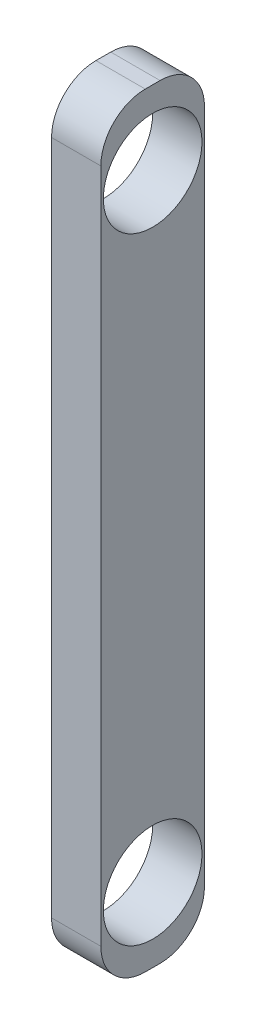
ISO-10303-21;
HEADER;
FILE_DESCRIPTION(('STEP AP214'),'2;1');
FILE_NAME('part.step','',(''),(''),'','','');
FILE_SCHEMA(('AUTOMOTIVE_DESIGN { 1 0 10303 214 1 1 1 1 }'));
ENDSEC;
DATA;
#1=APPLICATION_CONTEXT('core data for automotive mechanical design processes');
#2=APPLICATION_PROTOCOL_DEFINITION('international standard','automotive_design',2000,#1);
#3=PRODUCT_CONTEXT('',#1,'mechanical');
#4=PRODUCT('Part','Part','',(#3));
#5=PRODUCT_RELATED_PRODUCT_CATEGORY('part','',(#4));
#6=PRODUCT_DEFINITION_FORMATION('','',#4);
#7=PRODUCT_DEFINITION_CONTEXT('part definition',#1,'design');
#8=PRODUCT_DEFINITION('design','',#6,#7);
#9=PRODUCT_DEFINITION_SHAPE('','',#8);
#10=(LENGTH_UNIT() NAMED_UNIT(*) SI_UNIT(.MILLI.,.METRE.));
#11=(NAMED_UNIT(*) PLANE_ANGLE_UNIT() SI_UNIT($,.RADIAN.));
#12=(NAMED_UNIT(*) SI_UNIT($,.STERADIAN.) SOLID_ANGLE_UNIT());
#13=UNCERTAINTY_MEASURE_WITH_UNIT(LENGTH_MEASURE(1.E-05),#10,'distance_accuracy_value','');
#14=(GEOMETRIC_REPRESENTATION_CONTEXT(3) GLOBAL_UNCERTAINTY_ASSIGNED_CONTEXT((#13)) GLOBAL_UNIT_ASSIGNED_CONTEXT((#10,
#11,#12)) REPRESENTATION_CONTEXT('',''));
#15=CARTESIAN_POINT('',(0.,0.,0.));
#16=DIRECTION('',(0.,0.,1.));
#17=DIRECTION('',(1.,0.,0.));
#18=AXIS2_PLACEMENT_3D('',#15,#16,#17);
#19=CARTESIAN_POINT('',(2.,0.,0.));
#20=DIRECTION('',(1.,0.,0.));
#21=DIRECTION('',(0.,0.,-1.));
#22=AXIS2_PLACEMENT_3D('',#19,#20,#21);
#23=PLANE('',#22);
#24=CARTESIAN_POINT('',(2.,28.,0.));
#25=DIRECTION('',(1.,0.,0.));
#26=DIRECTION('',(0.,0.,-1.));
#27=AXIS2_PLACEMENT_3D('',#24,#25,#26);
#28=CIRCLE('',#27,2.);
#29=CARTESIAN_POINT('',(2.,28.,-2.));
#30=VERTEX_POINT('',#29);
#31=EDGE_CURVE('E143',#30,#30,#28,.T.);
#32=ORIENTED_EDGE('',*,*,#31,.F.);
#33=EDGE_LOOP('',(#32));
#34=FACE_BOUND('',#33,.T.);
#35=DIRECTION('',(0.,-1.,0.));
#36=VECTOR('',#35,1.);
#37=CARTESIAN_POINT('',(2.,31.,2.1));
#38=LINE('',#37,#36);
#39=CARTESIAN_POINT('',(2.,29.2,2.1));
#40=VERTEX_POINT('',#39);
#41=CARTESIAN_POINT('',(2.,1.8,2.1));
#42=VERTEX_POINT('',#41);
#43=EDGE_CURVE('E148',#40,#42,#38,.T.);
#44=ORIENTED_EDGE('',*,*,#43,.T.);
#45=CARTESIAN_POINT('',(2.,1.8,0.299999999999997));
#46=DIRECTION('',(1.,0.,0.));
#47=DIRECTION('',(0.,0.,-1.));
#48=AXIS2_PLACEMENT_3D('',#45,#46,#47);
#49=CIRCLE('',#48,1.8);
#50=CARTESIAN_POINT('',(2.,0.,0.299999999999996));
#51=VERTEX_POINT('',#50);
#52=EDGE_CURVE('E163',#42,#51,#49,.T.);
#53=ORIENTED_EDGE('',*,*,#52,.T.);
#54=DIRECTION('',(0.,0.,-1.));
#55=VECTOR('',#54,1.);
#56=CARTESIAN_POINT('',(2.,0.,2.1));
#57=LINE('',#56,#55);
#58=CARTESIAN_POINT('',(2.,0.,-0.300000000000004));
#59=VERTEX_POINT('',#58);
#60=EDGE_CURVE('E130',#51,#59,#57,.T.);
#61=ORIENTED_EDGE('',*,*,#60,.T.);
#62=CARTESIAN_POINT('',(2.,1.8,-0.300000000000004));
#63=DIRECTION('',(1.,0.,0.));
#64=DIRECTION('',(0.,0.,-1.));
#65=AXIS2_PLACEMENT_3D('',#62,#63,#64);
#66=CIRCLE('',#65,1.8);
#67=CARTESIAN_POINT('',(2.,1.8,-2.1));
#68=VERTEX_POINT('',#67);
#69=EDGE_CURVE('E161',#59,#68,#66,.T.);
#70=ORIENTED_EDGE('',*,*,#69,.T.);
#71=DIRECTION('',(0.,1.,0.));
#72=VECTOR('',#71,1.);
#73=CARTESIAN_POINT('',(2.,0.,-2.1));
#74=LINE('',#73,#72);
#75=CARTESIAN_POINT('',(2.,29.2,-2.1));
#76=VERTEX_POINT('',#75);
#77=EDGE_CURVE('E183',#68,#76,#74,.T.);
#78=ORIENTED_EDGE('',*,*,#77,.T.);
#79=CARTESIAN_POINT('',(2.,29.2,-0.3));
#80=DIRECTION('',(1.,0.,0.));
#81=DIRECTION('',(0.,0.,-1.));
#82=AXIS2_PLACEMENT_3D('',#79,#80,#81);
#83=CIRCLE('',#82,1.8);
#84=CARTESIAN_POINT('',(2.,31.,-0.3));
#85=VERTEX_POINT('',#84);
#86=EDGE_CURVE('E65',#76,#85,#83,.T.);
#87=ORIENTED_EDGE('',*,*,#86,.T.);
#88=DIRECTION('',(0.,0.,1.));
#89=VECTOR('',#88,1.);
#90=CARTESIAN_POINT('',(2.,31.,-2.1));
#91=LINE('',#90,#89);
#92=CARTESIAN_POINT('',(2.,31.,0.3));
#93=VERTEX_POINT('',#92);
#94=EDGE_CURVE('E149',#85,#93,#91,.T.);
#95=ORIENTED_EDGE('',*,*,#94,.T.);
#96=CARTESIAN_POINT('',(2.,29.2,0.3));
#97=DIRECTION('',(1.,0.,0.));
#98=DIRECTION('',(0.,0.,-1.));
#99=AXIS2_PLACEMENT_3D('',#96,#97,#98);
#100=CIRCLE('',#99,1.8);
#101=EDGE_CURVE('E159',#93,#40,#100,.T.);
#102=ORIENTED_EDGE('',*,*,#101,.T.);
#103=EDGE_LOOP('',(#44,#53,#61,#70,#78,#87,#95,#102));
#104=FACE_BOUND('',#103,.T.);
#105=CARTESIAN_POINT('',(2.,3.,0.));
#106=DIRECTION('',(1.,0.,0.));
#107=DIRECTION('',(0.,0.,-1.));
#108=AXIS2_PLACEMENT_3D('',#105,#106,#107);
#109=CIRCLE('',#108,2.);
#110=CARTESIAN_POINT('',(2.,3.,-2.));
#111=VERTEX_POINT('',#110);
#112=EDGE_CURVE('E195',#111,#111,#109,.T.);
#113=ORIENTED_EDGE('',*,*,#112,.F.);
#114=EDGE_LOOP('',(#113));
#115=FACE_BOUND('',#114,.T.);
#116=ADVANCED_FACE('F45',(#34,#104,#115),#23,.T.);
#117=CARTESIAN_POINT('',(0.,0.,0.));
#118=DIRECTION('',(1.,0.,0.));
#119=DIRECTION('',(0.,0.,-1.));
#120=AXIS2_PLACEMENT_3D('',#117,#118,#119);
#121=PLANE('',#120);
#122=DIRECTION('',(0.,0.,-1.));
#123=VECTOR('',#122,1.);
#124=CARTESIAN_POINT('',(0.,0.,2.1));
#125=LINE('',#124,#123);
#126=CARTESIAN_POINT('',(0.,0.,0.299999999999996));
#127=VERTEX_POINT('',#126);
#128=CARTESIAN_POINT('',(0.,0.,-0.300000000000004));
#129=VERTEX_POINT('',#128);
#130=EDGE_CURVE('E127',#127,#129,#125,.T.);
#131=ORIENTED_EDGE('',*,*,#130,.F.);
#132=CARTESIAN_POINT('',(0.,1.8,0.299999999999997));
#133=DIRECTION('',(1.,0.,0.));
#134=DIRECTION('',(0.,0.,-1.));
#135=AXIS2_PLACEMENT_3D('',#132,#133,#134);
#136=CIRCLE('',#135,1.8);
#137=CARTESIAN_POINT('',(0.,1.8,2.1));
#138=VERTEX_POINT('',#137);
#139=EDGE_CURVE('E110',#127,#138,#136,.F.);
#140=ORIENTED_EDGE('',*,*,#139,.T.);
#141=DIRECTION('',(0.,-1.,0.));
#142=VECTOR('',#141,1.);
#143=CARTESIAN_POINT('',(0.,31.,2.1));
#144=LINE('',#143,#142);
#145=CARTESIAN_POINT('',(0.,29.2,2.1));
#146=VERTEX_POINT('',#145);
#147=EDGE_CURVE('E138',#146,#138,#144,.T.);
#148=ORIENTED_EDGE('',*,*,#147,.F.);
#149=CARTESIAN_POINT('',(0.,29.2,0.3));
#150=DIRECTION('',(1.,0.,0.));
#151=DIRECTION('',(0.,0.,-1.));
#152=AXIS2_PLACEMENT_3D('',#149,#150,#151);
#153=CIRCLE('',#152,1.8);
#154=CARTESIAN_POINT('',(0.,31.,0.3));
#155=VERTEX_POINT('',#154);
#156=EDGE_CURVE('E152',#146,#155,#153,.F.);
#157=ORIENTED_EDGE('',*,*,#156,.T.);
#158=DIRECTION('',(0.,0.,1.));
#159=VECTOR('',#158,1.);
#160=CARTESIAN_POINT('',(0.,31.,-2.1));
#161=LINE('',#160,#159);
#162=CARTESIAN_POINT('',(0.,31.,-0.3));
#163=VERTEX_POINT('',#162);
#164=EDGE_CURVE('E141',#163,#155,#161,.T.);
#165=ORIENTED_EDGE('',*,*,#164,.F.);
#166=CARTESIAN_POINT('',(0.,29.2,-0.3));
#167=DIRECTION('',(1.,0.,0.));
#168=DIRECTION('',(0.,0.,-1.));
#169=AXIS2_PLACEMENT_3D('',#166,#167,#168);
#170=CIRCLE('',#169,1.8);
#171=CARTESIAN_POINT('',(0.,29.2,-2.1));
#172=VERTEX_POINT('',#171);
#173=EDGE_CURVE('E131',#163,#172,#170,.F.);
#174=ORIENTED_EDGE('',*,*,#173,.T.);
#175=DIRECTION('',(0.,1.,0.));
#176=VECTOR('',#175,1.);
#177=CARTESIAN_POINT('',(0.,0.,-2.1));
#178=LINE('',#177,#176);
#179=CARTESIAN_POINT('',(0.,1.8,-2.1));
#180=VERTEX_POINT('',#179);
#181=EDGE_CURVE('E137',#180,#172,#178,.T.);
#182=ORIENTED_EDGE('',*,*,#181,.F.);
#183=CARTESIAN_POINT('',(0.,1.8,-0.300000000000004));
#184=DIRECTION('',(1.,0.,0.));
#185=DIRECTION('',(0.,0.,-1.));
#186=AXIS2_PLACEMENT_3D('',#183,#184,#185);
#187=CIRCLE('',#186,1.8);
#188=EDGE_CURVE('E121',#180,#129,#187,.F.);
#189=ORIENTED_EDGE('',*,*,#188,.T.);
#190=EDGE_LOOP('',(#131,#140,#148,#157,#165,#174,#182,#189));
#191=FACE_BOUND('',#190,.T.);
#192=CARTESIAN_POINT('',(0.,28.,0.));
#193=DIRECTION('',(1.,0.,0.));
#194=DIRECTION('',(0.,0.,-1.));
#195=AXIS2_PLACEMENT_3D('',#192,#193,#194);
#196=CIRCLE('',#195,2.);
#197=CARTESIAN_POINT('',(0.,28.,-2.));
#198=VERTEX_POINT('',#197);
#199=EDGE_CURVE('E186',#198,#198,#196,.T.);
#200=ORIENTED_EDGE('',*,*,#199,.T.);
#201=EDGE_LOOP('',(#200));
#202=FACE_BOUND('',#201,.T.);
#203=CARTESIAN_POINT('',(0.,3.,0.));
#204=DIRECTION('',(1.,0.,0.));
#205=DIRECTION('',(0.,0.,-1.));
#206=AXIS2_PLACEMENT_3D('',#203,#204,#205);
#207=CIRCLE('',#206,2.);
#208=CARTESIAN_POINT('',(0.,3.,-2.));
#209=VERTEX_POINT('',#208);
#210=EDGE_CURVE('E197',#209,#209,#207,.T.);
#211=ORIENTED_EDGE('',*,*,#210,.T.);
#212=EDGE_LOOP('',(#211));
#213=FACE_BOUND('',#212,.T.);
#214=ADVANCED_FACE('F134',(#191,#202,#213),#121,.F.);
#215=CARTESIAN_POINT('',(2.,31.,2.1));
#216=DIRECTION('',(0.,0.,-1.));
#217=DIRECTION('',(0.,1.,0.));
#218=AXIS2_PLACEMENT_3D('',#215,#216,#217);
#219=PLANE('',#218);
#220=ORIENTED_EDGE('',*,*,#147,.T.);
#221=DIRECTION('',(-1.,0.,0.));
#222=VECTOR('',#221,1.);
#223=CARTESIAN_POINT('',(2.,1.8,2.1));
#224=LINE('',#223,#222);
#225=EDGE_CURVE('E115',#138,#42,#224,.F.);
#226=ORIENTED_EDGE('',*,*,#225,.T.);
#227=ORIENTED_EDGE('',*,*,#43,.F.);
#228=DIRECTION('',(-1.,0.,0.));
#229=VECTOR('',#228,1.);
#230=CARTESIAN_POINT('',(2.,29.2,2.1));
#231=LINE('',#230,#229);
#232=EDGE_CURVE('E120',#40,#146,#231,.T.);
#233=ORIENTED_EDGE('',*,*,#232,.T.);
#234=EDGE_LOOP('',(#220,#226,#227,#233));
#235=FACE_BOUND('',#234,.T.);
#236=ADVANCED_FACE('F180',(#235),#219,.F.);
#237=CARTESIAN_POINT('',(2.,0.,2.1));
#238=DIRECTION('',(0.,1.,0.));
#239=DIRECTION('',(0.,0.,1.));
#240=AXIS2_PLACEMENT_3D('',#237,#238,#239);
#241=PLANE('',#240);
#242=ORIENTED_EDGE('',*,*,#60,.F.);
#243=DIRECTION('',(-1.,0.,0.));
#244=VECTOR('',#243,1.);
#245=CARTESIAN_POINT('',(2.,0.,0.299999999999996));
#246=LINE('',#245,#244);
#247=EDGE_CURVE('E114',#51,#127,#246,.T.);
#248=ORIENTED_EDGE('',*,*,#247,.T.);
#249=ORIENTED_EDGE('',*,*,#130,.T.);
#250=DIRECTION('',(-1.,0.,0.));
#251=VECTOR('',#250,1.);
#252=CARTESIAN_POINT('',(2.,0.,-0.300000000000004));
#253=LINE('',#252,#251);
#254=EDGE_CURVE('E132',#129,#59,#253,.F.);
#255=ORIENTED_EDGE('',*,*,#254,.T.);
#256=EDGE_LOOP('',(#242,#248,#249,#255));
#257=FACE_BOUND('',#256,.T.);
#258=ADVANCED_FACE('F126',(#257),#241,.F.);
#259=CARTESIAN_POINT('',(2.,0.,-2.1));
#260=DIRECTION('',(0.,0.,1.));
#261=DIRECTION('',(0.,-1.,0.));
#262=AXIS2_PLACEMENT_3D('',#259,#260,#261);
#263=PLANE('',#262);
#264=ORIENTED_EDGE('',*,*,#77,.F.);
#265=DIRECTION('',(-1.,0.,0.));
#266=VECTOR('',#265,1.);
#267=CARTESIAN_POINT('',(2.,1.8,-2.1));
#268=LINE('',#267,#266);
#269=EDGE_CURVE('E167',#68,#180,#268,.T.);
#270=ORIENTED_EDGE('',*,*,#269,.T.);
#271=ORIENTED_EDGE('',*,*,#181,.T.);
#272=DIRECTION('',(-1.,0.,0.));
#273=VECTOR('',#272,1.);
#274=CARTESIAN_POINT('',(2.,29.2,-2.1));
#275=LINE('',#274,#273);
#276=EDGE_CURVE('E165',#172,#76,#275,.F.);
#277=ORIENTED_EDGE('',*,*,#276,.T.);
#278=EDGE_LOOP('',(#264,#270,#271,#277));
#279=FACE_BOUND('',#278,.T.);
#280=ADVANCED_FACE('F226',(#279),#263,.F.);
#281=CARTESIAN_POINT('',(2.,31.,-2.1));
#282=DIRECTION('',(0.,-1.,0.));
#283=DIRECTION('',(0.,0.,-1.));
#284=AXIS2_PLACEMENT_3D('',#281,#282,#283);
#285=PLANE('',#284);
#286=ORIENTED_EDGE('',*,*,#164,.T.);
#287=DIRECTION('',(-1.,0.,0.));
#288=VECTOR('',#287,1.);
#289=CARTESIAN_POINT('',(2.,31.,0.3));
#290=LINE('',#289,#288);
#291=EDGE_CURVE('E11',#155,#93,#290,.F.);
#292=ORIENTED_EDGE('',*,*,#291,.T.);
#293=ORIENTED_EDGE('',*,*,#94,.F.);
#294=DIRECTION('',(-1.,0.,0.));
#295=VECTOR('',#294,1.);
#296=CARTESIAN_POINT('',(2.,31.,-0.3));
#297=LINE('',#296,#295);
#298=EDGE_CURVE('E53',#85,#163,#297,.T.);
#299=ORIENTED_EDGE('',*,*,#298,.T.);
#300=EDGE_LOOP('',(#286,#292,#293,#299));
#301=FACE_BOUND('',#300,.T.);
#302=ADVANCED_FACE('F172',(#301),#285,.F.);
#303=CARTESIAN_POINT('',(2.,28.,0.));
#304=DIRECTION('',(-1.,0.,0.));
#305=DIRECTION('',(0.,0.,1.));
#306=AXIS2_PLACEMENT_3D('',#303,#304,#305);
#307=CYLINDRICAL_SURFACE('',#306,2.);
#308=ORIENTED_EDGE('',*,*,#31,.T.);
#309=EDGE_LOOP('',(#308));
#310=FACE_BOUND('',#309,.T.);
#311=ORIENTED_EDGE('',*,*,#199,.F.);
#312=EDGE_LOOP('',(#311));
#313=FACE_BOUND('',#312,.T.);
#314=ADVANCED_FACE('F205',(#310,#313),#307,.F.);
#315=CARTESIAN_POINT('',(2.,3.,0.));
#316=DIRECTION('',(-1.,0.,0.));
#317=DIRECTION('',(0.,0.,1.));
#318=AXIS2_PLACEMENT_3D('',#315,#316,#317);
#319=CYLINDRICAL_SURFACE('',#318,2.);
#320=ORIENTED_EDGE('',*,*,#112,.T.);
#321=EDGE_LOOP('',(#320));
#322=FACE_BOUND('',#321,.T.);
#323=ORIENTED_EDGE('',*,*,#210,.F.);
#324=EDGE_LOOP('',(#323));
#325=FACE_BOUND('',#324,.T.);
#326=ADVANCED_FACE('F208',(#322,#325),#319,.F.);
#327=CARTESIAN_POINT('',(2.,1.8,0.299999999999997));
#328=DIRECTION('',(-1.,0.,0.));
#329=DIRECTION('',(0.,0.,1.));
#330=AXIS2_PLACEMENT_3D('',#327,#328,#329);
#331=CYLINDRICAL_SURFACE('',#330,1.8);
#332=ORIENTED_EDGE('',*,*,#52,.F.);
#333=ORIENTED_EDGE('',*,*,#225,.F.);
#334=ORIENTED_EDGE('',*,*,#139,.F.);
#335=ORIENTED_EDGE('',*,*,#247,.F.);
#336=EDGE_LOOP('',(#332,#333,#334,#335));
#337=FACE_BOUND('',#336,.T.);
#338=ADVANCED_FACE('F113',(#337),#331,.T.);
#339=CARTESIAN_POINT('',(2.,1.8,-0.300000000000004));
#340=DIRECTION('',(-1.,0.,0.));
#341=DIRECTION('',(0.,0.,1.));
#342=AXIS2_PLACEMENT_3D('',#339,#340,#341);
#343=CYLINDRICAL_SURFACE('',#342,1.8);
#344=ORIENTED_EDGE('',*,*,#69,.F.);
#345=ORIENTED_EDGE('',*,*,#254,.F.);
#346=ORIENTED_EDGE('',*,*,#188,.F.);
#347=ORIENTED_EDGE('',*,*,#269,.F.);
#348=EDGE_LOOP('',(#344,#345,#346,#347));
#349=FACE_BOUND('',#348,.T.);
#350=ADVANCED_FACE('F221',(#349),#343,.T.);
#351=CARTESIAN_POINT('',(2.,29.2,0.3));
#352=DIRECTION('',(-1.,0.,0.));
#353=DIRECTION('',(0.,0.,1.));
#354=AXIS2_PLACEMENT_3D('',#351,#352,#353);
#355=CYLINDRICAL_SURFACE('',#354,1.8);
#356=ORIENTED_EDGE('',*,*,#101,.F.);
#357=ORIENTED_EDGE('',*,*,#291,.F.);
#358=ORIENTED_EDGE('',*,*,#156,.F.);
#359=ORIENTED_EDGE('',*,*,#232,.F.);
#360=EDGE_LOOP('',(#356,#357,#358,#359));
#361=FACE_BOUND('',#360,.T.);
#362=ADVANCED_FACE('F177',(#361),#355,.T.);
#363=CARTESIAN_POINT('',(2.,29.2,-0.3));
#364=DIRECTION('',(-1.,0.,0.));
#365=DIRECTION('',(0.,0.,1.));
#366=AXIS2_PLACEMENT_3D('',#363,#364,#365);
#367=CYLINDRICAL_SURFACE('',#366,1.8);
#368=ORIENTED_EDGE('',*,*,#86,.F.);
#369=ORIENTED_EDGE('',*,*,#276,.F.);
#370=ORIENTED_EDGE('',*,*,#173,.F.);
#371=ORIENTED_EDGE('',*,*,#298,.F.);
#372=EDGE_LOOP('',(#368,#369,#370,#371));
#373=FACE_BOUND('',#372,.T.);
#374=ADVANCED_FACE('F47',(#373),#367,.T.);
#375=CLOSED_SHELL('',(#116,#214,#236,#258,#280,#302,#314,#326,#338,#350,#362,#374));
#376=MANIFOLD_SOLID_BREP('B2',#375);
#377=ADVANCED_BREP_SHAPE_REPRESENTATION('',(#18,#376),#14);
#378=SHAPE_DEFINITION_REPRESENTATION(#9,#377);
ENDSEC;
END-ISO-10303-21;
